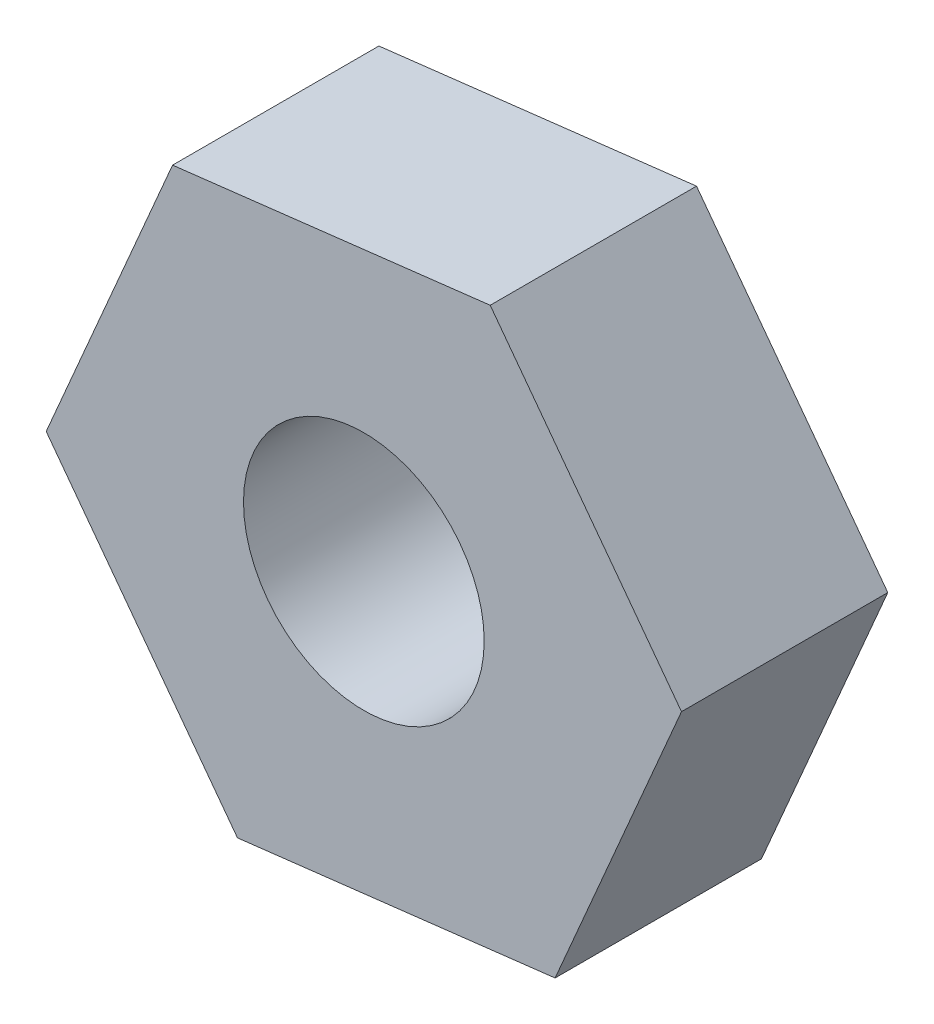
ISO-10303-21;
HEADER;
FILE_DESCRIPTION(('STEP AP214'),'2;1');
FILE_NAME('part.step','',(''),(''),'','','');
FILE_SCHEMA(('AUTOMOTIVE_DESIGN { 1 0 10303 214 1 1 1 1 }'));
ENDSEC;
DATA;
#1=APPLICATION_CONTEXT('core data for automotive mechanical design processes');
#2=APPLICATION_PROTOCOL_DEFINITION('international standard','automotive_design',2000,#1);
#3=PRODUCT_CONTEXT('',#1,'mechanical');
#4=PRODUCT('Part','Part','',(#3));
#5=PRODUCT_RELATED_PRODUCT_CATEGORY('part','',(#4));
#6=PRODUCT_DEFINITION_FORMATION('','',#4);
#7=PRODUCT_DEFINITION_CONTEXT('part definition',#1,'design');
#8=PRODUCT_DEFINITION('design','',#6,#7);
#9=PRODUCT_DEFINITION_SHAPE('','',#8);
#10=(LENGTH_UNIT() NAMED_UNIT(*) SI_UNIT(.MILLI.,.METRE.));
#11=(NAMED_UNIT(*) PLANE_ANGLE_UNIT() SI_UNIT($,.RADIAN.));
#12=(NAMED_UNIT(*) SI_UNIT($,.STERADIAN.) SOLID_ANGLE_UNIT());
#13=UNCERTAINTY_MEASURE_WITH_UNIT(LENGTH_MEASURE(1.E-05),#10,'distance_accuracy_value','');
#14=(GEOMETRIC_REPRESENTATION_CONTEXT(3) GLOBAL_UNCERTAINTY_ASSIGNED_CONTEXT((#13)) GLOBAL_UNIT_ASSIGNED_CONTEXT((#10,
#11,#12)) REPRESENTATION_CONTEXT('',''));
#15=CARTESIAN_POINT('',(0.,0.,0.));
#16=DIRECTION('',(0.,0.,1.));
#17=DIRECTION('',(1.,0.,0.));
#18=AXIS2_PLACEMENT_3D('',#15,#16,#17);
#19=CARTESIAN_POINT('',(3.67517697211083,8.54480225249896,6.));
#20=DIRECTION('',(0.117141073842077,-0.993115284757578,0.));
#21=DIRECTION('',(0.993115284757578,0.117141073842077,0.));
#22=AXIS2_PLACEMENT_3D('',#19,#20,#21);
#23=PLANE('',#22);
#24=DIRECTION('',(-0.993115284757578,-0.117141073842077,0.));
#25=VECTOR('',#24,1.);
#26=CARTESIAN_POINT('',(3.67517697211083,8.54480225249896,0.));
#27=LINE('',#26,#25);
#28=CARTESIAN_POINT('',(3.67517697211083,8.54480225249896,0.));
#29=VERTEX_POINT('',#28);
#30=CARTESIAN_POINT('',(-5.56242733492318,7.45519774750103,0.));
#31=VERTEX_POINT('',#30);
#32=EDGE_CURVE('E117',#29,#31,#27,.T.);
#33=ORIENTED_EDGE('',*,*,#32,.T.);
#34=DIRECTION('',(0.,0.,-1.));
#35=VECTOR('',#34,1.);
#36=CARTESIAN_POINT('',(-5.56242733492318,7.45519774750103,6.));
#37=LINE('',#36,#35);
#38=CARTESIAN_POINT('',(-5.56242733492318,7.45519774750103,6.));
#39=VERTEX_POINT('',#38);
#40=EDGE_CURVE('E11',#39,#31,#37,.T.);
#41=ORIENTED_EDGE('',*,*,#40,.F.);
#42=DIRECTION('',(-0.993115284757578,-0.117141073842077,0.));
#43=VECTOR('',#42,1.);
#44=CARTESIAN_POINT('',(3.67517697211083,8.54480225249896,6.));
#45=LINE('',#44,#43);
#46=CARTESIAN_POINT('',(3.67517697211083,8.54480225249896,6.));
#47=VERTEX_POINT('',#46);
#48=EDGE_CURVE('E128',#47,#39,#45,.T.);
#49=ORIENTED_EDGE('',*,*,#48,.F.);
#50=DIRECTION('',(0.,0.,-1.));
#51=VECTOR('',#50,1.);
#52=CARTESIAN_POINT('',(3.67517697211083,8.54480225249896,6.));
#53=LINE('',#52,#51);
#54=EDGE_CURVE('E113',#47,#29,#53,.T.);
#55=ORIENTED_EDGE('',*,*,#54,.T.);
#56=EDGE_LOOP('',(#33,#41,#49,#55));
#57=FACE_BOUND('',#56,.T.);
#58=ADVANCED_FACE('F33',(#57),#23,.F.);
#59=CARTESIAN_POINT('',(-5.56242733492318,7.45519774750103,6.));
#60=DIRECTION('',(0.918633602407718,-0.395110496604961,0.));
#61=DIRECTION('',(0.395110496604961,0.918633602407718,0.));
#62=AXIS2_PLACEMENT_3D('',#59,#60,#61);
#63=PLANE('',#62);
#64=DIRECTION('',(-0.395110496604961,-0.918633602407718,0.));
#65=VECTOR('',#64,1.);
#66=CARTESIAN_POINT('',(-5.56242733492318,7.45519774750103,0.));
#67=LINE('',#66,#65);
#68=CARTESIAN_POINT('',(-9.23760430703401,-1.08960450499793,0.));
#69=VERTEX_POINT('',#68);
#70=EDGE_CURVE('E120',#31,#69,#67,.T.);
#71=ORIENTED_EDGE('',*,*,#70,.T.);
#72=DIRECTION('',(0.,0.,-1.));
#73=VECTOR('',#72,1.);
#74=CARTESIAN_POINT('',(-9.23760430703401,-1.08960450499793,6.));
#75=LINE('',#74,#73);
#76=CARTESIAN_POINT('',(-9.23760430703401,-1.08960450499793,6.));
#77=VERTEX_POINT('',#76);
#78=EDGE_CURVE('E41',#77,#69,#75,.T.);
#79=ORIENTED_EDGE('',*,*,#78,.F.);
#80=DIRECTION('',(-0.395110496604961,-0.918633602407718,0.));
#81=VECTOR('',#80,1.);
#82=CARTESIAN_POINT('',(-5.56242733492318,7.45519774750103,6.));
#83=LINE('',#82,#81);
#84=EDGE_CURVE('E86',#39,#77,#83,.T.);
#85=ORIENTED_EDGE('',*,*,#84,.F.);
#86=ORIENTED_EDGE('',*,*,#40,.T.);
#87=EDGE_LOOP('',(#71,#79,#85,#86));
#88=FACE_BOUND('',#87,.T.);
#89=ADVANCED_FACE('F153',(#88),#63,.F.);
#90=CARTESIAN_POINT('',(-9.23760430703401,-1.08960450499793,6.));
#91=DIRECTION('',(0.80149252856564,0.598004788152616,0.));
#92=DIRECTION('',(-0.598004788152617,0.801492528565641,0.));
#93=AXIS2_PLACEMENT_3D('',#90,#91,#92);
#94=PLANE('',#93);
#95=DIRECTION('',(0.598004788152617,-0.801492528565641,0.));
#96=VECTOR('',#95,1.);
#97=CARTESIAN_POINT('',(-9.23760430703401,-1.08960450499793,0.));
#98=LINE('',#97,#96);
#99=CARTESIAN_POINT('',(-3.67517697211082,-8.54480225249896,0.));
#100=VERTEX_POINT('',#99);
#101=EDGE_CURVE('E123',#69,#100,#98,.T.);
#102=ORIENTED_EDGE('',*,*,#101,.T.);
#103=DIRECTION('',(0.,0.,-1.));
#104=VECTOR('',#103,1.);
#105=CARTESIAN_POINT('',(-3.67517697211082,-8.54480225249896,6.));
#106=LINE('',#105,#104);
#107=CARTESIAN_POINT('',(-3.67517697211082,-8.54480225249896,6.));
#108=VERTEX_POINT('',#107);
#109=EDGE_CURVE('E108',#108,#100,#106,.T.);
#110=ORIENTED_EDGE('',*,*,#109,.F.);
#111=DIRECTION('',(0.598004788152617,-0.801492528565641,0.));
#112=VECTOR('',#111,1.);
#113=CARTESIAN_POINT('',(-9.23760430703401,-1.08960450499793,6.));
#114=LINE('',#113,#112);
#115=EDGE_CURVE('E99',#77,#108,#114,.T.);
#116=ORIENTED_EDGE('',*,*,#115,.F.);
#117=ORIENTED_EDGE('',*,*,#78,.T.);
#118=EDGE_LOOP('',(#102,#110,#116,#117));
#119=FACE_BOUND('',#118,.T.);
#120=ADVANCED_FACE('F134',(#119),#94,.F.);
#121=CARTESIAN_POINT('',(-3.67517697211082,-8.54480225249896,6.));
#122=DIRECTION('',(-0.117141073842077,0.993115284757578,0.));
#123=DIRECTION('',(-0.993115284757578,-0.117141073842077,0.));
#124=AXIS2_PLACEMENT_3D('',#121,#122,#123);
#125=PLANE('',#124);
#126=DIRECTION('',(0.993115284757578,0.117141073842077,0.));
#127=VECTOR('',#126,1.);
#128=CARTESIAN_POINT('',(-3.67517697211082,-8.54480225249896,0.));
#129=LINE('',#128,#127);
#130=CARTESIAN_POINT('',(5.56242733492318,-7.45519774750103,0.));
#131=VERTEX_POINT('',#130);
#132=EDGE_CURVE('E107',#100,#131,#129,.T.);
#133=ORIENTED_EDGE('',*,*,#132,.T.);
#134=DIRECTION('',(0.,0.,-1.));
#135=VECTOR('',#134,1.);
#136=CARTESIAN_POINT('',(5.56242733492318,-7.45519774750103,6.));
#137=LINE('',#136,#135);
#138=CARTESIAN_POINT('',(5.56242733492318,-7.45519774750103,6.));
#139=VERTEX_POINT('',#138);
#140=EDGE_CURVE('E104',#139,#131,#137,.T.);
#141=ORIENTED_EDGE('',*,*,#140,.F.);
#142=DIRECTION('',(0.993115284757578,0.117141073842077,0.));
#143=VECTOR('',#142,1.);
#144=CARTESIAN_POINT('',(-3.67517697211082,-8.54480225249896,6.));
#145=LINE('',#144,#143);
#146=EDGE_CURVE('E93',#108,#139,#145,.T.);
#147=ORIENTED_EDGE('',*,*,#146,.F.);
#148=ORIENTED_EDGE('',*,*,#109,.T.);
#149=EDGE_LOOP('',(#133,#141,#147,#148));
#150=FACE_BOUND('',#149,.T.);
#151=ADVANCED_FACE('F105',(#150),#125,.F.);
#152=CARTESIAN_POINT('',(5.56242733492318,-7.45519774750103,6.));
#153=DIRECTION('',(-0.918633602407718,0.395110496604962,0.));
#154=DIRECTION('',(-0.395110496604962,-0.918633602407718,0.));
#155=AXIS2_PLACEMENT_3D('',#152,#153,#154);
#156=PLANE('',#155);
#157=DIRECTION('',(0.395110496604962,0.918633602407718,0.));
#158=VECTOR('',#157,1.);
#159=CARTESIAN_POINT('',(5.56242733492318,-7.45519774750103,0.));
#160=LINE('',#159,#158);
#161=CARTESIAN_POINT('',(9.23760430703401,1.08960450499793,0.));
#162=VERTEX_POINT('',#161);
#163=EDGE_CURVE('E72',#131,#162,#160,.T.);
#164=ORIENTED_EDGE('',*,*,#163,.T.);
#165=DIRECTION('',(0.,0.,-1.));
#166=VECTOR('',#165,1.);
#167=CARTESIAN_POINT('',(9.23760430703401,1.08960450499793,6.));
#168=LINE('',#167,#166);
#169=CARTESIAN_POINT('',(9.23760430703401,1.08960450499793,6.));
#170=VERTEX_POINT('',#169);
#171=EDGE_CURVE('E109',#170,#162,#168,.T.);
#172=ORIENTED_EDGE('',*,*,#171,.F.);
#173=DIRECTION('',(0.395110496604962,0.918633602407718,0.));
#174=VECTOR('',#173,1.);
#175=CARTESIAN_POINT('',(5.56242733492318,-7.45519774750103,6.));
#176=LINE('',#175,#174);
#177=EDGE_CURVE('E97',#139,#170,#176,.T.);
#178=ORIENTED_EDGE('',*,*,#177,.F.);
#179=ORIENTED_EDGE('',*,*,#140,.T.);
#180=EDGE_LOOP('',(#164,#172,#178,#179));
#181=FACE_BOUND('',#180,.T.);
#182=ADVANCED_FACE('F111',(#181),#156,.F.);
#183=CARTESIAN_POINT('',(9.23760430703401,1.08960450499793,6.));
#184=DIRECTION('',(-0.80149252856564,-0.598004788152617,0.));
#185=DIRECTION('',(0.598004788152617,-0.801492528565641,0.));
#186=AXIS2_PLACEMENT_3D('',#183,#184,#185);
#187=PLANE('',#186);
#188=DIRECTION('',(-0.598004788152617,0.801492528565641,0.));
#189=VECTOR('',#188,1.);
#190=CARTESIAN_POINT('',(9.23760430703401,1.08960450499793,0.));
#191=LINE('',#190,#189);
#192=EDGE_CURVE('E78',#162,#29,#191,.T.);
#193=ORIENTED_EDGE('',*,*,#192,.T.);
#194=ORIENTED_EDGE('',*,*,#54,.F.);
#195=DIRECTION('',(-0.598004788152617,0.801492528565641,0.));
#196=VECTOR('',#195,1.);
#197=CARTESIAN_POINT('',(9.23760430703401,1.08960450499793,6.));
#198=LINE('',#197,#196);
#199=EDGE_CURVE('E49',#170,#47,#198,.T.);
#200=ORIENTED_EDGE('',*,*,#199,.F.);
#201=ORIENTED_EDGE('',*,*,#171,.T.);
#202=EDGE_LOOP('',(#193,#194,#200,#201));
#203=FACE_BOUND('',#202,.T.);
#204=ADVANCED_FACE('F141',(#203),#187,.F.);
#205=CARTESIAN_POINT('',(0.,0.,6.));
#206=DIRECTION('',(0.,0.,1.));
#207=DIRECTION('',(1.,0.,0.));
#208=AXIS2_PLACEMENT_3D('',#205,#206,#207);
#209=PLANE('',#208);
#210=CARTESIAN_POINT('',(0.,0.,6.));
#211=DIRECTION('',(0.,0.,1.));
#212=DIRECTION('',(1.,0.,0.));
#213=AXIS2_PLACEMENT_3D('',#210,#211,#212);
#214=CIRCLE('',#213,3.49999999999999);
#215=CARTESIAN_POINT('',(3.49999999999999,0.,6.));
#216=VERTEX_POINT('',#215);
#217=EDGE_CURVE('E208',#216,#216,#214,.T.);
#218=ORIENTED_EDGE('',*,*,#217,.F.);
#219=EDGE_LOOP('',(#218));
#220=FACE_BOUND('',#219,.T.);
#221=ORIENTED_EDGE('',*,*,#48,.T.);
#222=ORIENTED_EDGE('',*,*,#84,.T.);
#223=ORIENTED_EDGE('',*,*,#115,.T.);
#224=ORIENTED_EDGE('',*,*,#146,.T.);
#225=ORIENTED_EDGE('',*,*,#177,.T.);
#226=ORIENTED_EDGE('',*,*,#199,.T.);
#227=EDGE_LOOP('',(#221,#222,#223,#224,#225,#226));
#228=FACE_BOUND('',#227,.T.);
#229=ADVANCED_FACE('F95',(#220,#228),#209,.T.);
#230=CARTESIAN_POINT('',(0.,0.,0.));
#231=DIRECTION('',(0.,0.,1.));
#232=DIRECTION('',(1.,0.,0.));
#233=AXIS2_PLACEMENT_3D('',#230,#231,#232);
#234=PLANE('',#233);
#235=CARTESIAN_POINT('',(0.,0.,0.));
#236=DIRECTION('',(0.,0.,1.));
#237=DIRECTION('',(1.,0.,0.));
#238=AXIS2_PLACEMENT_3D('',#235,#236,#237);
#239=CIRCLE('',#238,3.49999999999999);
#240=CARTESIAN_POINT('',(3.49999999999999,0.,0.));
#241=VERTEX_POINT('',#240);
#242=EDGE_CURVE('E121',#241,#241,#239,.T.);
#243=ORIENTED_EDGE('',*,*,#242,.T.);
#244=EDGE_LOOP('',(#243));
#245=FACE_BOUND('',#244,.T.);
#246=ORIENTED_EDGE('',*,*,#32,.F.);
#247=ORIENTED_EDGE('',*,*,#192,.F.);
#248=ORIENTED_EDGE('',*,*,#163,.F.);
#249=ORIENTED_EDGE('',*,*,#132,.F.);
#250=ORIENTED_EDGE('',*,*,#101,.F.);
#251=ORIENTED_EDGE('',*,*,#70,.F.);
#252=EDGE_LOOP('',(#246,#247,#248,#249,#250,#251));
#253=FACE_BOUND('',#252,.T.);
#254=ADVANCED_FACE('F137',(#245,#253),#234,.F.);
#255=CARTESIAN_POINT('',(0.,0.,6.));
#256=DIRECTION('',(0.,0.,1.));
#257=DIRECTION('',(1.,0.,0.));
#258=AXIS2_PLACEMENT_3D('',#255,#256,#257);
#259=CYLINDRICAL_SURFACE('',#258,3.49999999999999);
#260=ORIENTED_EDGE('',*,*,#242,.F.);
#261=EDGE_LOOP('',(#260));
#262=FACE_BOUND('',#261,.T.);
#263=ORIENTED_EDGE('',*,*,#217,.T.);
#264=EDGE_LOOP('',(#263));
#265=FACE_BOUND('',#264,.T.);
#266=ADVANCED_FACE('F190',(#262,#265),#259,.F.);
#267=CLOSED_SHELL('',(#58,#89,#120,#151,#182,#204,#229,#254,#266));
#268=MANIFOLD_SOLID_BREP('B2',#267);
#269=ADVANCED_BREP_SHAPE_REPRESENTATION('',(#18,#268),#14);
#270=SHAPE_DEFINITION_REPRESENTATION(#9,#269);
ENDSEC;
END-ISO-10303-21;
